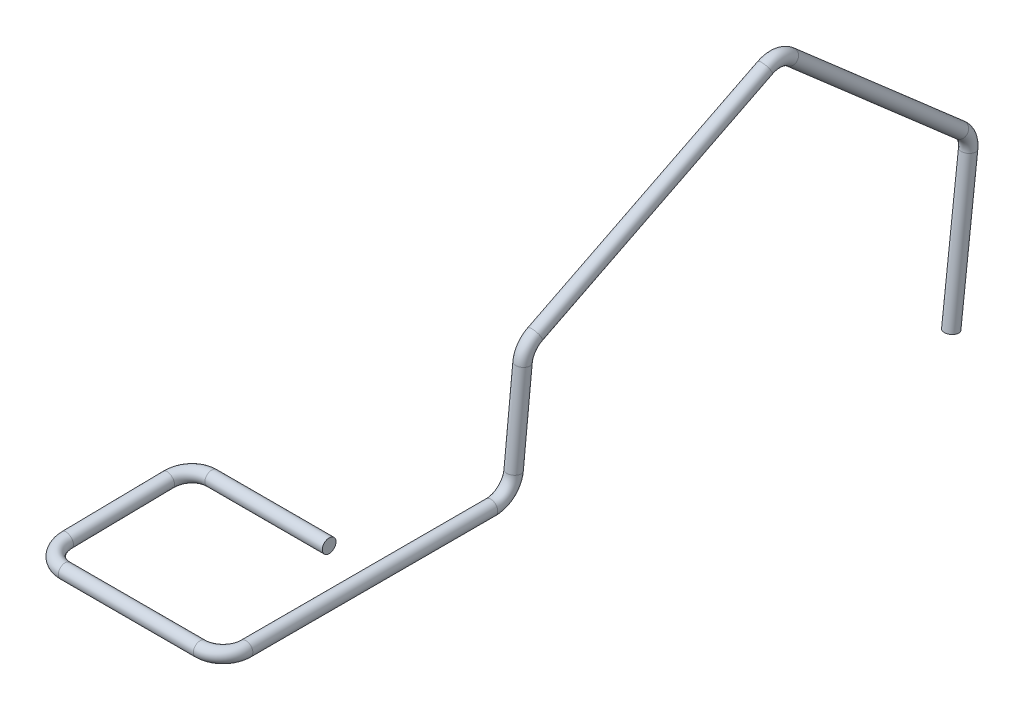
ISO-10303-21;
HEADER;
FILE_DESCRIPTION(('STEP AP214'),'2;1');
FILE_NAME('part.step','',(''),(''),'','','');
FILE_SCHEMA(('AUTOMOTIVE_DESIGN { 1 0 10303 214 1 1 1 1 }'));
ENDSEC;
DATA;
#1=APPLICATION_CONTEXT('core data for automotive mechanical design processes');
#2=APPLICATION_PROTOCOL_DEFINITION('international standard','automotive_design',2000,#1);
#3=PRODUCT_CONTEXT('',#1,'mechanical');
#4=PRODUCT('Part','Part','',(#3));
#5=PRODUCT_RELATED_PRODUCT_CATEGORY('part','',(#4));
#6=PRODUCT_DEFINITION_FORMATION('','',#4);
#7=PRODUCT_DEFINITION_CONTEXT('part definition',#1,'design');
#8=PRODUCT_DEFINITION('design','',#6,#7);
#9=PRODUCT_DEFINITION_SHAPE('','',#8);
#10=(LENGTH_UNIT() NAMED_UNIT(*) SI_UNIT(.MILLI.,.METRE.));
#11=(NAMED_UNIT(*) PLANE_ANGLE_UNIT() SI_UNIT($,.RADIAN.));
#12=(NAMED_UNIT(*) SI_UNIT($,.STERADIAN.) SOLID_ANGLE_UNIT());
#13=UNCERTAINTY_MEASURE_WITH_UNIT(LENGTH_MEASURE(1.E-05),#10,'distance_accuracy_value','');
#14=(GEOMETRIC_REPRESENTATION_CONTEXT(3) GLOBAL_UNCERTAINTY_ASSIGNED_CONTEXT((#13)) GLOBAL_UNIT_ASSIGNED_CONTEXT((#10,
#11,#12)) REPRESENTATION_CONTEXT('',''));
#15=CARTESIAN_POINT('',(0.,0.,0.));
#16=DIRECTION('',(0.,0.,1.));
#17=DIRECTION('',(1.,0.,0.));
#18=AXIS2_PLACEMENT_3D('',#15,#16,#17);
#19=CARTESIAN_POINT('',(0.,5.99065980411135,-61.9893611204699));
#20=DIRECTION('',(0.,-0.993532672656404,0.113546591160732));
#21=DIRECTION('',(0.,-0.113546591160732,-0.993532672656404));
#22=AXIS2_PLACEMENT_3D('',#19,#20,#21);
#23=CYLINDRICAL_SURFACE('',#22,0.5715);
#24=CARTESIAN_POINT('',(0.,5.99065980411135,-61.9893611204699));
#25=DIRECTION('',(0.,0.993532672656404,-0.113546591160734));
#26=DIRECTION('',(0.972636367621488,0.0263805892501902,0.230830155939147));
#27=AXIS2_PLACEMENT_3D('',#24,#25,#26);
#28=CIRCLE('',#27,0.5715);
#29=CARTESIAN_POINT('',(0.,5.92576792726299,-62.557165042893));
#30=VERTEX_POINT('',#29);
#31=EDGE_CURVE('E34',#30,#30,#28,.T.);
#32=ORIENTED_EDGE('',*,*,#31,.F.);
#33=EDGE_LOOP('',(#32));
#34=FACE_BOUND('',#33,.T.);
#35=CARTESIAN_POINT('',(0.,-6.34999999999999,-60.579));
#36=DIRECTION('',(0.,0.993532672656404,-0.113546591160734));
#37=DIRECTION('',(0.972636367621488,0.0263805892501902,0.230830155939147));
#38=AXIS2_PLACEMENT_3D('',#35,#36,#37);
#39=CIRCLE('',#38,0.5715);
#40=CARTESIAN_POINT('',(0.555861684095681,-6.33492349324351,-60.4470805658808));
#41=VERTEX_POINT('',#40);
#42=EDGE_CURVE('E10',#41,#41,#39,.T.);
#43=ORIENTED_EDGE('',*,*,#42,.T.);
#44=EDGE_LOOP('',(#43));
#45=FACE_BOUND('',#44,.T.);
#46=ADVANCED_FACE('F28',(#34,#45),#23,.T.);
#47=CARTESIAN_POINT('',(0.,6.20696606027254,-60.0966813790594));
#48=DIRECTION('',(-1.,0.,0.));
#49=DIRECTION('',(0.,0.,1.));
#50=AXIS2_PLACEMENT_3D('',#47,#48,#49);
#51=TOROIDAL_SURFACE('',#50,1.905,0.5715);
#52=CARTESIAN_POINT('',(0.,7.64275721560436,-61.3486912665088));
#53=DIRECTION('',(0.,0.657223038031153,0.753696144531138));
#54=DIRECTION('',(0.972636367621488,-0.175108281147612,0.15269442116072));
#55=AXIS2_PLACEMENT_3D('',#52,#53,#54);
#56=CIRCLE('',#55,0.5715);
#57=CARTESIAN_POINT('',(0.,8.0734945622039,-61.7242942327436));
#58=VERTEX_POINT('',#57);
#59=EDGE_CURVE('E38',#58,#58,#56,.T.);
#60=CARTESIAN_POINT('',(0.,6.20696606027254,-60.0966813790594));
#61=DIRECTION('',(-1.,0.,0.));
#62=DIRECTION('',(0.,0.,1.));
#63=AXIS2_PLACEMENT_3D('',#60,#61,#62);
#64=CIRCLE('',#63,2.4765);
#65=EDGE_CURVE('',#58,#30,#64,.T.);
#66=ORIENTED_EDGE('',*,*,#59,.F.);
#67=ORIENTED_EDGE('',*,*,#31,.T.);
#68=ORIENTED_EDGE('',*,*,#65,.T.);
#69=ORIENTED_EDGE('',*,*,#65,.F.);
#70=EDGE_LOOP('',(#66,#68,#67,#69));
#71=FACE_BOUND('',#70,.T.);
#72=ADVANCED_FACE('F156',(#71),#51,.T.);
#73=CARTESIAN_POINT('',(0.,19.9868341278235,-47.1926397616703));
#74=DIRECTION('',(0.,-0.657223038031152,-0.753696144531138));
#75=DIRECTION('',(0.,0.753696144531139,-0.657223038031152));
#76=AXIS2_PLACEMENT_3D('',#73,#74,#75);
#77=CYLINDRICAL_SURFACE('',#76,0.5715);
#78=CARTESIAN_POINT('',(0.,19.9868341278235,-47.1926397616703));
#79=DIRECTION('',(0.,0.657223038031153,0.753696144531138));
#80=DIRECTION('',(0.972636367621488,-0.175108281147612,0.15269442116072));
#81=AXIS2_PLACEMENT_3D('',#78,#79,#80);
#82=CIRCLE('',#81,0.5715);
#83=CARTESIAN_POINT('',(0.,20.417571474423,-47.5682427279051));
#84=VERTEX_POINT('',#83);
#85=EDGE_CURVE('E42',#84,#84,#82,.T.);
#86=CARTESIAN_POINT('',(0.,20.417571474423,-47.5682427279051));
#87=CARTESIAN_POINT('',(0.,20.2889873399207,-47.7157015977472));
#88=CARTESIAN_POINT('',(0.,20.1604032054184,-47.8631604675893));
#89=CARTESIAN_POINT('',(0.,19.9032349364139,-48.1580782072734));
#90=CARTESIAN_POINT('',(0.,19.7746508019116,-48.3055370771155));
#91=CARTESIAN_POINT('',(0.,19.517482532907,-48.6004548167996));
#92=CARTESIAN_POINT('',(0.,19.3888983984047,-48.7479136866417));
#93=CARTESIAN_POINT('',(0.,19.1317301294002,-49.0428314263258));
#94=CARTESIAN_POINT('',(0.,19.0031459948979,-49.1902902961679));
#95=CARTESIAN_POINT('',(0.,18.7459777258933,-49.485208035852));
#96=CARTESIAN_POINT('',(0.,18.617393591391,-49.6326669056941));
#97=CARTESIAN_POINT('',(0.,18.3602253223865,-49.9275846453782));
#98=CARTESIAN_POINT('',(0.,18.2316411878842,-50.0750435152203));
#99=CARTESIAN_POINT('',(0.,17.9744729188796,-50.3699612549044));
#100=CARTESIAN_POINT('',(0.,17.8458887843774,-50.5174201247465));
#101=CARTESIAN_POINT('',(0.,17.5887205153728,-50.8123378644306));
#102=CARTESIAN_POINT('',(0.,17.4601363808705,-50.9597967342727));
#103=CARTESIAN_POINT('',(0.,17.2029681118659,-51.2547144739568));
#104=CARTESIAN_POINT('',(0.,17.0743839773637,-51.4021733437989));
#105=CARTESIAN_POINT('',(0.,16.8172157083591,-51.697091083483));
#106=CARTESIAN_POINT('',(0.,16.6886315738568,-51.8445499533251));
#107=CARTESIAN_POINT('',(0.,16.4314633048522,-52.1394676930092));
#108=CARTESIAN_POINT('',(0.,16.30287917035,-52.2869265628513));
#109=CARTESIAN_POINT('',(0.,16.0457109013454,-52.5818443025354));
#110=CARTESIAN_POINT('',(0.,15.9171267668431,-52.7293031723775));
#111=CARTESIAN_POINT('',(0.,15.6599584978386,-53.0242209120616));
#112=CARTESIAN_POINT('',(0.,15.5313743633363,-53.1716797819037));
#113=CARTESIAN_POINT('',(0.,15.2742060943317,-53.4665975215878));
#114=CARTESIAN_POINT('',(0.,15.1456219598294,-53.6140563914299));
#115=CARTESIAN_POINT('',(0.,14.8884536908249,-53.908974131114));
#116=CARTESIAN_POINT('',(0.,14.7598695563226,-54.0564330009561));
#117=CARTESIAN_POINT('',(0.,14.502701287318,-54.3513507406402));
#118=CARTESIAN_POINT('',(0.,14.3741171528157,-54.4988096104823));
#119=CARTESIAN_POINT('',(0.,14.1169488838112,-54.7937273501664));
#120=CARTESIAN_POINT('',(0.,13.9883647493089,-54.9411862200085));
#121=CARTESIAN_POINT('',(0.,13.7311964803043,-55.2361039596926));
#122=CARTESIAN_POINT('',(0.,13.602612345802,-55.3835628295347));
#123=CARTESIAN_POINT('',(0.,13.3454440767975,-55.6784805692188));
#124=CARTESIAN_POINT('',(0.,13.2168599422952,-55.8259394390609));
#125=CARTESIAN_POINT('',(0.,12.9596916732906,-56.120857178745));
#126=CARTESIAN_POINT('',(0.,12.8311075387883,-56.2683160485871));
#127=CARTESIAN_POINT('',(0.,12.5739392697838,-56.5632337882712));
#128=CARTESIAN_POINT('',(0.,12.4453551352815,-56.7106926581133));
#129=CARTESIAN_POINT('',(0.,12.1881868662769,-57.0056103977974));
#130=CARTESIAN_POINT('',(0.,12.0596027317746,-57.1530692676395));
#131=CARTESIAN_POINT('',(0.,11.8024344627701,-57.4479870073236));
#132=CARTESIAN_POINT('',(0.,11.6738503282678,-57.5954458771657));
#133=CARTESIAN_POINT('',(0.,11.4166820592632,-57.8903636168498));
#134=CARTESIAN_POINT('',(0.,11.288097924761,-58.0378224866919));
#135=CARTESIAN_POINT('',(0.,11.0309296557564,-58.332740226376));
#136=CARTESIAN_POINT('',(0.,10.9023455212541,-58.4801990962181));
#137=CARTESIAN_POINT('',(0.,10.6451772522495,-58.7751168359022));
#138=CARTESIAN_POINT('',(0.,10.5165931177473,-58.9225757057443));
#139=CARTESIAN_POINT('',(0.,10.2594248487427,-59.2174934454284));
#140=CARTESIAN_POINT('',(0.,10.1308407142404,-59.3649523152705));
#141=CARTESIAN_POINT('',(0.,9.87367244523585,-59.6598700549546));
#142=CARTESIAN_POINT('',(0.,9.74508831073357,-59.8073289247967));
#143=CARTESIAN_POINT('',(0.,9.48792004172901,-60.1022466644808));
#144=CARTESIAN_POINT('',(0.,9.35933590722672,-60.2497055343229));
#145=CARTESIAN_POINT('',(0.,9.10216763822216,-60.544623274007));
#146=CARTESIAN_POINT('',(0.,8.97358350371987,-60.6920821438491));
#147=CARTESIAN_POINT('',(0.,8.71641523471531,-60.9869998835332));
#148=CARTESIAN_POINT('',(0.,8.58783110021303,-61.1344587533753));
#149=CARTESIAN_POINT('',(0.,8.33066283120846,-61.4293764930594));
#150=CARTESIAN_POINT('',(0.,8.20207869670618,-61.5768353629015));
#151=CARTESIAN_POINT('',(0.,8.0734945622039,-61.7242942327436));
#152=B_SPLINE_CURVE_WITH_KNOTS('',3,(#86,#87,#88,#89,#90,#91,#92,#93,#94,#95,#96,#97,#98,#99,
#100,#101,#102,#103,#104,#105,#106,#107,#108,#109,#110,#111,#112,#113,#114,#115,#116,#117,#118,
#119,#120,#121,#122,#123,#124,#125,#126,#127,#128,#129,#130,#131,#132,#133,#134,#135,#136,#137,
#138,#139,#140,#141,#142,#143,#144,#145,#146,#147,#148,#149,#150,#151),.UNSPECIFIED.,.F.,.F.,(4,
2,2,2,2,2,2,2,2,2,2,2,2,2,2,2,2,2,2,2,2,2,2,2,2,2,2,2,2,2,2,2,4),(0.,0.586942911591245,
1.17388582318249,1.76082873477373,2.34777164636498,2.93471455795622,3.52165746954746,
4.1086003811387,4.69554329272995,5.28248620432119,5.86942911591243,6.45637202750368,
7.04331493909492,7.63025785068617,8.21720076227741,8.80414367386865,9.39108658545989,
9.97802949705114,10.5649724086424,11.1519153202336,11.7388582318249,12.3258011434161,
12.9127440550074,13.4996869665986,14.0866298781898,14.6735727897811,15.2605157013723,
15.8474586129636,16.4344015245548,17.0213444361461,17.6082873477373,18.1952302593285,
18.7821731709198),.UNSPECIFIED.);
#153=EDGE_CURVE('BSEAM150',#84,#58,#152,.T.);
#154=ORIENTED_EDGE('',*,*,#85,.F.);
#155=ORIENTED_EDGE('',*,*,#59,.T.);
#156=ORIENTED_EDGE('',*,*,#153,.T.);
#157=ORIENTED_EDGE('',*,*,#153,.F.);
#158=EDGE_LOOP('',(#154,#156,#155,#157));
#159=FACE_BOUND('',#158,.T.);
#160=ADVANCED_FACE('F150',(#159),#77,.T.);
#161=CARTESIAN_POINT('',(0.,18.5510429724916,-45.940629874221));
#162=DIRECTION('',(-1.,0.,0.));
#163=DIRECTION('',(0.,0.,1.));
#164=AXIS2_PLACEMENT_3D('',#161,#162,#163);
#165=TOROIDAL_SURFACE('',#164,1.905,0.5715);
#166=CARTESIAN_POINT('',(0.,20.252883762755,-45.0846141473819));
#167=DIRECTION('',(0.,-0.449352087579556,0.893354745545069));
#168=DIRECTION('',(0.972636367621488,-0.207555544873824,-0.104399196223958));
#169=AXIS2_PLACEMENT_3D('',#166,#167,#168);
#170=CIRCLE('',#169,0.5715);
#171=CARTESIAN_POINT('',(0.,20.763435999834,-44.8278094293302));
#172=VERTEX_POINT('',#171);
#173=EDGE_CURVE('E47',#172,#172,#170,.T.);
#174=CARTESIAN_POINT('',(0.,18.5510429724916,-45.940629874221));
#175=DIRECTION('',(-1.,0.,0.));
#176=DIRECTION('',(0.,0.,1.));
#177=AXIS2_PLACEMENT_3D('',#174,#175,#176);
#178=CIRCLE('',#177,2.4765);
#179=EDGE_CURVE('',#172,#84,#178,.T.);
#180=ORIENTED_EDGE('',*,*,#173,.F.);
#181=ORIENTED_EDGE('',*,*,#85,.T.);
#182=ORIENTED_EDGE('',*,*,#179,.T.);
#183=ORIENTED_EDGE('',*,*,#179,.F.);
#184=EDGE_LOOP('',(#180,#182,#181,#183));
#185=FACE_BOUND('',#184,.T.);
#186=ADVANCED_FACE('F144',(#185),#165,.T.);
#187=CARTESIAN_POINT('',(0.,10.6304749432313,-25.9543489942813));
#188=DIRECTION('',(0.,0.449352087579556,-0.893354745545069));
#189=DIRECTION('',(0.,0.893354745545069,0.449352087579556));
#190=AXIS2_PLACEMENT_3D('',#187,#188,#189);
#191=CYLINDRICAL_SURFACE('',#190,0.5715);
#192=CARTESIAN_POINT('',(0.,10.6304749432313,-25.9543489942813));
#193=DIRECTION('',(0.,-0.449352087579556,0.893354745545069));
#194=DIRECTION('',(0.972636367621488,-0.207555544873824,-0.104399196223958));
#195=AXIS2_PLACEMENT_3D('',#192,#193,#194);
#196=CIRCLE('',#195,0.5715);
#197=CARTESIAN_POINT('',(0.,11.1410271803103,-25.6975442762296));
#198=VERTEX_POINT('',#197);
#199=EDGE_CURVE('E50',#198,#198,#196,.T.);
#200=ORIENTED_EDGE('',*,*,#199,.F.);
#201=EDGE_LOOP('',(#200));
#202=FACE_BOUND('',#201,.T.);
#203=ORIENTED_EDGE('',*,*,#173,.T.);
#204=EDGE_LOOP('',(#203));
#205=FACE_BOUND('',#204,.T.);
#206=ADVANCED_FACE('F138',(#202,#205),#191,.T.);
#207=CARTESIAN_POINT('',(0.,8.92863415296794,-26.8103647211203));
#208=DIRECTION('',(-1.,0.,0.));
#209=DIRECTION('',(0.,0.,1.));
#210=AXIS2_PLACEMENT_3D('',#207,#208,#209);
#211=TOROIDAL_SURFACE('',#210,1.905,0.5715);
#212=CARTESIAN_POINT('',(0.,9.11818873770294,-24.9148188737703));
#213=DIRECTION('',(0.,-0.995037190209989,0.0995037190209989));
#214=DIRECTION('',(0.972636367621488,-0.0231179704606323,-0.231179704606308));
#215=AXIS2_PLACEMENT_3D('',#212,#213,#214);
#216=CIRCLE('',#215,0.5715);
#217=CARTESIAN_POINT('',(0.,9.17505511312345,-24.3461551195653));
#218=VERTEX_POINT('',#217);
#219=EDGE_CURVE('E53',#218,#218,#216,.T.);
#220=CARTESIAN_POINT('',(0.,8.92863415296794,-26.8103647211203));
#221=DIRECTION('',(-1.,0.,0.));
#222=DIRECTION('',(0.,0.,1.));
#223=AXIS2_PLACEMENT_3D('',#220,#221,#222);
#224=CIRCLE('',#223,2.4765);
#225=EDGE_CURVE('',#218,#198,#224,.T.);
#226=ORIENTED_EDGE('',*,*,#219,.F.);
#227=ORIENTED_EDGE('',*,*,#199,.T.);
#228=ORIENTED_EDGE('',*,*,#225,.T.);
#229=ORIENTED_EDGE('',*,*,#225,.F.);
#230=EDGE_LOOP('',(#226,#228,#227,#229));
#231=FACE_BOUND('',#230,.T.);
#232=ADVANCED_FACE('F132',(#231),#211,.T.);
#233=CARTESIAN_POINT('',(0.,1.715445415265,-24.1745445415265));
#234=DIRECTION('',(0.,0.995037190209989,-0.0995037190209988));
#235=DIRECTION('',(0.,0.0995037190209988,0.995037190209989));
#236=AXIS2_PLACEMENT_3D('',#233,#234,#235);
#237=CYLINDRICAL_SURFACE('',#236,0.5715);
#238=CARTESIAN_POINT('',(0.,1.715445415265,-24.1745445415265));
#239=DIRECTION('',(0.,-0.995037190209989,0.0995037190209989));
#240=DIRECTION('',(0.972636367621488,-0.0231179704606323,-0.231179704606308));
#241=AXIS2_PLACEMENT_3D('',#238,#239,#240);
#242=CIRCLE('',#241,0.5715);
#243=CARTESIAN_POINT('',(0.,1.65857903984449,-24.7432082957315));
#244=VERTEX_POINT('',#243);
#245=EDGE_CURVE('E56',#244,#244,#242,.T.);
#246=ORIENTED_EDGE('',*,*,#245,.F.);
#247=EDGE_LOOP('',(#246));
#248=FACE_BOUND('',#247,.T.);
#249=ORIENTED_EDGE('',*,*,#219,.T.);
#250=EDGE_LOOP('',(#249));
#251=FACE_BOUND('',#250,.T.);
#252=ADVANCED_FACE('F126',(#248,#251),#237,.T.);
#253=CARTESIAN_POINT('',(0.,1.905,-22.2789986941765));
#254=DIRECTION('',(1.,0.,0.));
#255=DIRECTION('',(0.,0.,-1.));
#256=AXIS2_PLACEMENT_3D('',#253,#254,#255);
#257=TOROIDAL_SURFACE('',#256,1.905,0.5715);
#258=CARTESIAN_POINT('',(0.,0.,-22.2789986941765));
#259=DIRECTION('',(0.,0.,1.));
#260=DIRECTION('',(0.972636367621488,-0.232332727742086,0.));
#261=AXIS2_PLACEMENT_3D('',#258,#259,#260);
#262=CIRCLE('',#261,0.5715);
#263=CARTESIAN_POINT('',(0.,-0.571500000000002,-22.2789986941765));
#264=VERTEX_POINT('',#263);
#265=EDGE_CURVE('E59',#264,#264,#262,.T.);
#266=CARTESIAN_POINT('',(0.,1.905,-22.2789986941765));
#267=DIRECTION('',(1.,0.,0.));
#268=DIRECTION('',(0.,0.,-1.));
#269=AXIS2_PLACEMENT_3D('',#266,#267,#268);
#270=CIRCLE('',#269,2.4765);
#271=EDGE_CURVE('',#264,#244,#270,.T.);
#272=ORIENTED_EDGE('',*,*,#265,.F.);
#273=ORIENTED_EDGE('',*,*,#245,.T.);
#274=ORIENTED_EDGE('',*,*,#271,.T.);
#275=ORIENTED_EDGE('',*,*,#271,.F.);
#276=EDGE_LOOP('',(#272,#274,#273,#275));
#277=FACE_BOUND('',#276,.T.);
#278=ADVANCED_FACE('F120',(#277),#257,.T.);
#279=CARTESIAN_POINT('',(0.,0.,-1.905));
#280=DIRECTION('',(0.,0.,-1.));
#281=DIRECTION('',(0.,1.,0.));
#282=AXIS2_PLACEMENT_3D('',#279,#280,#281);
#283=CYLINDRICAL_SURFACE('',#282,0.5715);
#284=CARTESIAN_POINT('',(0.,0.,-1.905));
#285=DIRECTION('',(0.,0.,1.));
#286=DIRECTION('',(0.972636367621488,-0.232332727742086,0.));
#287=AXIS2_PLACEMENT_3D('',#284,#285,#286);
#288=CIRCLE('',#287,0.5715);
#289=CARTESIAN_POINT('',(0.5715,0.,-1.905));
#290=VERTEX_POINT('',#289);
#291=EDGE_CURVE('E62',#290,#290,#288,.T.);
#292=ORIENTED_EDGE('',*,*,#291,.F.);
#293=EDGE_LOOP('',(#292));
#294=FACE_BOUND('',#293,.T.);
#295=ORIENTED_EDGE('',*,*,#265,.T.);
#296=EDGE_LOOP('',(#295));
#297=FACE_BOUND('',#296,.T.);
#298=ADVANCED_FACE('F114',(#294,#297),#283,.T.);
#299=CARTESIAN_POINT('',(-1.905,0.,-1.905));
#300=DIRECTION('',(0.,1.,0.));
#301=DIRECTION('',(0.,0.,1.));
#302=AXIS2_PLACEMENT_3D('',#299,#300,#301);
#303=TOROIDAL_SURFACE('',#302,1.905,0.5715);
#304=CARTESIAN_POINT('',(-1.905,0.,0.));
#305=DIRECTION('',(-1.,0.,0.));
#306=DIRECTION('',(0.,-0.232332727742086,0.972636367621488));
#307=AXIS2_PLACEMENT_3D('',#304,#305,#306);
#308=CIRCLE('',#307,0.5715);
#309=CARTESIAN_POINT('',(-1.905,0.,0.5715));
#310=VERTEX_POINT('',#309);
#311=EDGE_CURVE('E65',#310,#310,#308,.T.);
#312=CARTESIAN_POINT('',(-1.905,0.,-1.905));
#313=DIRECTION('',(0.,1.,0.));
#314=DIRECTION('',(0.,0.,1.));
#315=AXIS2_PLACEMENT_3D('',#312,#313,#314);
#316=CIRCLE('',#315,2.4765);
#317=EDGE_CURVE('',#310,#290,#316,.T.);
#318=ORIENTED_EDGE('',*,*,#311,.F.);
#319=ORIENTED_EDGE('',*,*,#291,.T.);
#320=ORIENTED_EDGE('',*,*,#317,.T.);
#321=ORIENTED_EDGE('',*,*,#317,.F.);
#322=EDGE_LOOP('',(#318,#320,#319,#321));
#323=FACE_BOUND('',#322,.T.);
#324=ADVANCED_FACE('F108',(#323),#303,.T.);
#325=CARTESIAN_POINT('',(-13.136436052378,0.,0.));
#326=DIRECTION('',(1.,0.,0.));
#327=DIRECTION('',(0.,0.,-1.));
#328=AXIS2_PLACEMENT_3D('',#325,#326,#327);
#329=CYLINDRICAL_SURFACE('',#328,0.5715);
#330=CARTESIAN_POINT('',(-13.136436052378,0.,0.));
#331=DIRECTION('',(-1.,0.,0.));
#332=DIRECTION('',(0.,-0.232332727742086,0.972636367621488));
#333=AXIS2_PLACEMENT_3D('',#330,#331,#332);
#334=CIRCLE('',#333,0.5715);
#335=CARTESIAN_POINT('',(-13.136436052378,-0.0668479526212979,0.567576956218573));
#336=VERTEX_POINT('',#335);
#337=EDGE_CURVE('E68',#336,#336,#334,.T.);
#338=ORIENTED_EDGE('',*,*,#337,.F.);
#339=EDGE_LOOP('',(#338));
#340=FACE_BOUND('',#339,.T.);
#341=ORIENTED_EDGE('',*,*,#311,.T.);
#342=EDGE_LOOP('',(#341));
#343=FACE_BOUND('',#342,.T.);
#344=ADVANCED_FACE('F102',(#340,#343),#329,.T.);
#345=CARTESIAN_POINT('',(-13.136436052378,0.222826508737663,-1.89192318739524));
#346=DIRECTION('',(0.,0.993135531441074,0.116969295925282));
#347=DIRECTION('',(0.,-0.116969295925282,0.993135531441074));
#348=AXIS2_PLACEMENT_3D('',#345,#346,#347);
#349=TOROIDAL_SURFACE('',#348,1.905,0.5715);
#350=CARTESIAN_POINT('',(-15.0321103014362,0.244847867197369,-2.07889698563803));
#351=DIRECTION('',(0.0988273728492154,0.116396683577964,-0.988273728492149));
#352=DIRECTION('',(-0.988273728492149,-0.104685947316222,-0.111157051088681));
#353=AXIS2_PLACEMENT_3D('',#350,#351,#352);
#354=CIRCLE('',#353,0.5715);
#355=CARTESIAN_POINT('',(-15.6008125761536,0.25145427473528,-2.13498912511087));
#356=VERTEX_POINT('',#355);
#357=EDGE_CURVE('E71',#356,#356,#354,.T.);
#358=CARTESIAN_POINT('',(-13.136436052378,0.222826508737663,-1.89192318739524));
#359=DIRECTION('',(0.,0.993135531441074,0.116969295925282));
#360=DIRECTION('',(0.,-0.116969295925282,0.993135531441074));
#361=AXIS2_PLACEMENT_3D('',#358,#359,#360);
#362=CIRCLE('',#361,2.4765);
#363=EDGE_CURVE('',#356,#336,#362,.T.);
#364=ORIENTED_EDGE('',*,*,#357,.F.);
#365=ORIENTED_EDGE('',*,*,#337,.T.);
#366=ORIENTED_EDGE('',*,*,#363,.T.);
#367=ORIENTED_EDGE('',*,*,#363,.F.);
#368=EDGE_LOOP('',(#364,#366,#365,#367));
#369=FACE_BOUND('',#368,.T.);
#370=ADVANCED_FACE('F96',(#369),#349,.T.);
#371=CARTESIAN_POINT('',(-14.2674949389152,1.14539484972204,-9.72505061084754));
#372=DIRECTION('',(-0.0988273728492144,-0.116396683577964,0.988273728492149));
#373=DIRECTION('',(0.,-0.993135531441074,-0.116969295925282));
#374=AXIS2_PLACEMENT_3D('',#371,#372,#373);
#375=CYLINDRICAL_SURFACE('',#374,0.5715);
#376=CARTESIAN_POINT('',(-14.2674949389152,1.14539484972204,-9.72505061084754));
#377=DIRECTION('',(0.0988273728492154,0.116396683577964,-0.988273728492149));
#378=DIRECTION('',(-0.988273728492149,-0.104685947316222,-0.111157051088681));
#379=AXIS2_PLACEMENT_3D('',#376,#377,#378);
#380=CIRCLE('',#379,0.5715);
#381=CARTESIAN_POINT('',(-14.8361972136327,1.15200125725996,-9.78114275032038));
#382=VERTEX_POINT('',#381);
#383=EDGE_CURVE('E74',#382,#382,#380,.T.);
#384=ORIENTED_EDGE('',*,*,#383,.F.);
#385=EDGE_LOOP('',(#384));
#386=FACE_BOUND('',#385,.T.);
#387=ORIENTED_EDGE('',*,*,#357,.T.);
#388=EDGE_LOOP('',(#387));
#389=FACE_BOUND('',#388,.T.);
#390=ADVANCED_FACE('F90',(#386,#389),#375,.T.);
#391=CARTESIAN_POINT('',(-12.3718206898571,1.12337349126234,-9.53807681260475));
#392=DIRECTION('',(0.,0.993135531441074,0.116969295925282));
#393=DIRECTION('',(0.,-0.116969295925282,0.993135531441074));
#394=AXIS2_PLACEMENT_3D('',#391,#392,#393);
#395=TOROIDAL_SURFACE('',#394,1.905,0.5715);
#396=CARTESIAN_POINT('',(-12.3718206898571,1.3462,-11.43));
#397=DIRECTION('',(1.,0.,0.));
#398=DIRECTION('',(0.,0.,-1.));
#399=AXIS2_PLACEMENT_3D('',#396,#397,#398);
#400=CIRCLE('',#399,0.5715);
#401=CARTESIAN_POINT('',(-12.3718206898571,1.4130479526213,-11.9975769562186));
#402=VERTEX_POINT('',#401);
#403=EDGE_CURVE('E77',#402,#402,#400,.T.);
#404=CARTESIAN_POINT('',(-12.3718206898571,1.12337349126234,-9.53807681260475));
#405=DIRECTION('',(0.,0.993135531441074,0.116969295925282));
#406=DIRECTION('',(0.,-0.116969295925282,0.993135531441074));
#407=AXIS2_PLACEMENT_3D('',#404,#405,#406);
#408=CIRCLE('',#407,2.4765);
#409=EDGE_CURVE('',#402,#382,#408,.T.);
#410=ORIENTED_EDGE('',*,*,#403,.F.);
#411=ORIENTED_EDGE('',*,*,#383,.T.);
#412=ORIENTED_EDGE('',*,*,#409,.T.);
#413=ORIENTED_EDGE('',*,*,#409,.F.);
#414=EDGE_LOOP('',(#410,#412,#411,#413));
#415=FACE_BOUND('',#414,.T.);
#416=ADVANCED_FACE('F87',(#415),#395,.T.);
#417=CARTESIAN_POINT('',(-12.3718206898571,1.3462,-11.43));
#418=DIRECTION('',(1.,0.,0.));
#419=DIRECTION('',(0.,0.,-1.));
#420=AXIS2_PLACEMENT_3D('',#417,#418,#419);
#421=CYLINDRICAL_SURFACE('',#420,0.5715);
#422=ORIENTED_EDGE('',*,*,#403,.T.);
#423=EDGE_LOOP('',(#422));
#424=FACE_BOUND('',#423,.T.);
#425=CARTESIAN_POINT('',(-2.6035,1.3462,-11.43));
#426=DIRECTION('',(1.,0.,0.));
#427=DIRECTION('',(0.,0.,-1.));
#428=AXIS2_PLACEMENT_3D('',#425,#426,#427);
#429=CIRCLE('',#428,0.5715);
#430=CARTESIAN_POINT('',(-2.6035,1.3462,-12.0015));
#431=VERTEX_POINT('',#430);
#432=EDGE_CURVE('E78',#431,#431,#429,.T.);
#433=ORIENTED_EDGE('',*,*,#432,.F.);
#434=EDGE_LOOP('',(#433));
#435=FACE_BOUND('',#434,.T.);
#436=ADVANCED_FACE('F84',(#424,#435),#421,.T.);
#437=CARTESIAN_POINT('',(0.,-6.34999999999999,-60.579));
#438=DIRECTION('',(0.,0.993532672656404,-0.113546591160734));
#439=DIRECTION('',(0.972636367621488,0.0263805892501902,0.230830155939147));
#440=AXIS2_PLACEMENT_3D('',#437,#438,#439);
#441=PLANE('',#440);
#442=ORIENTED_EDGE('',*,*,#42,.F.);
#443=EDGE_LOOP('',(#442));
#444=FACE_BOUND('',#443,.T.);
#445=ADVANCED_FACE('F168',(#444),#441,.F.);
#446=CARTESIAN_POINT('',(-2.6035,1.3462,-11.43));
#447=DIRECTION('',(1.,0.,0.));
#448=DIRECTION('',(0.,0.,-1.));
#449=AXIS2_PLACEMENT_3D('',#446,#447,#448);
#450=PLANE('',#449);
#451=ORIENTED_EDGE('',*,*,#432,.T.);
#452=EDGE_LOOP('',(#451));
#453=FACE_BOUND('',#452,.T.);
#454=ADVANCED_FACE('F169',(#453),#450,.T.);
#455=CLOSED_SHELL('',(#46,#72,#160,#186,#206,#232,#252,#278,#298,#324,#344,#370,#390,#416,#436,
#445,#454));
#456=MANIFOLD_SOLID_BREP('B2',#455);
#457=ADVANCED_BREP_SHAPE_REPRESENTATION('',(#18,#456),#14);
#458=SHAPE_DEFINITION_REPRESENTATION(#9,#457);
ENDSEC;
END-ISO-10303-21;
